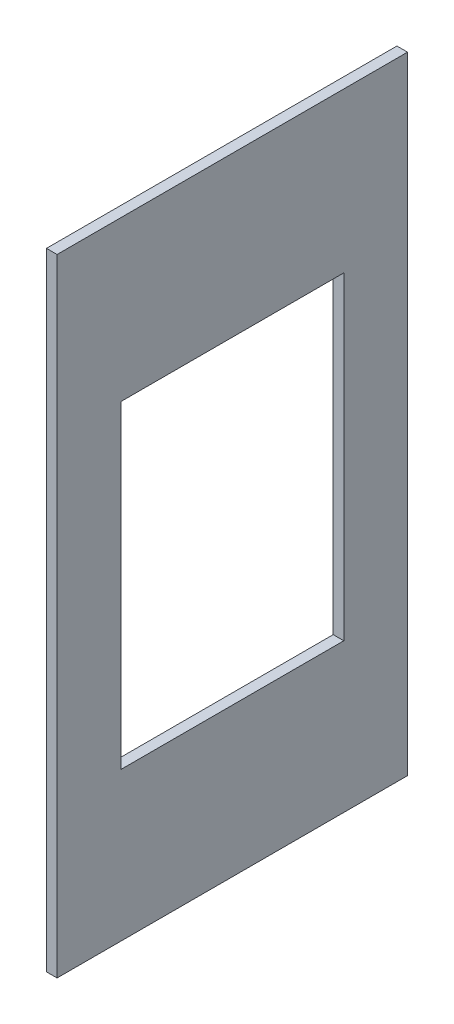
from build123d import *

# Parameters (mm, degrees)
SKETCH1_W          = 419.1
SKETCH1_H          = 749.3
EXTRUDE1_DEPTH     = 12.7
SKETCH2_W          = 266.7
SKETCH2_H          = 381
CUT_EXTRUDE1_DEPTH = 430.45909584


with BuildPart() as part:
    # Sketch1 → Extrude1 (new body)
    with BuildSketch(Plane(origin=(0, 0, 0), x_dir=(0, 0, -1), z_dir=(1, 0, 0))):
        Rectangle(SKETCH1_W, SKETCH1_H)
    extrude(amount=EXTRUDE1_DEPTH)

    # Sketch2 → Cut-Extrude1 (cut, through all)
    with BuildSketch(Plane.ZY):
        with Locations((0, -6.35)):
            Rectangle(SKETCH2_W, SKETCH2_H)
    extrude(amount=-CUT_EXTRUDE1_DEPTH, mode=Mode.SUBTRACT)


solid = part.part
